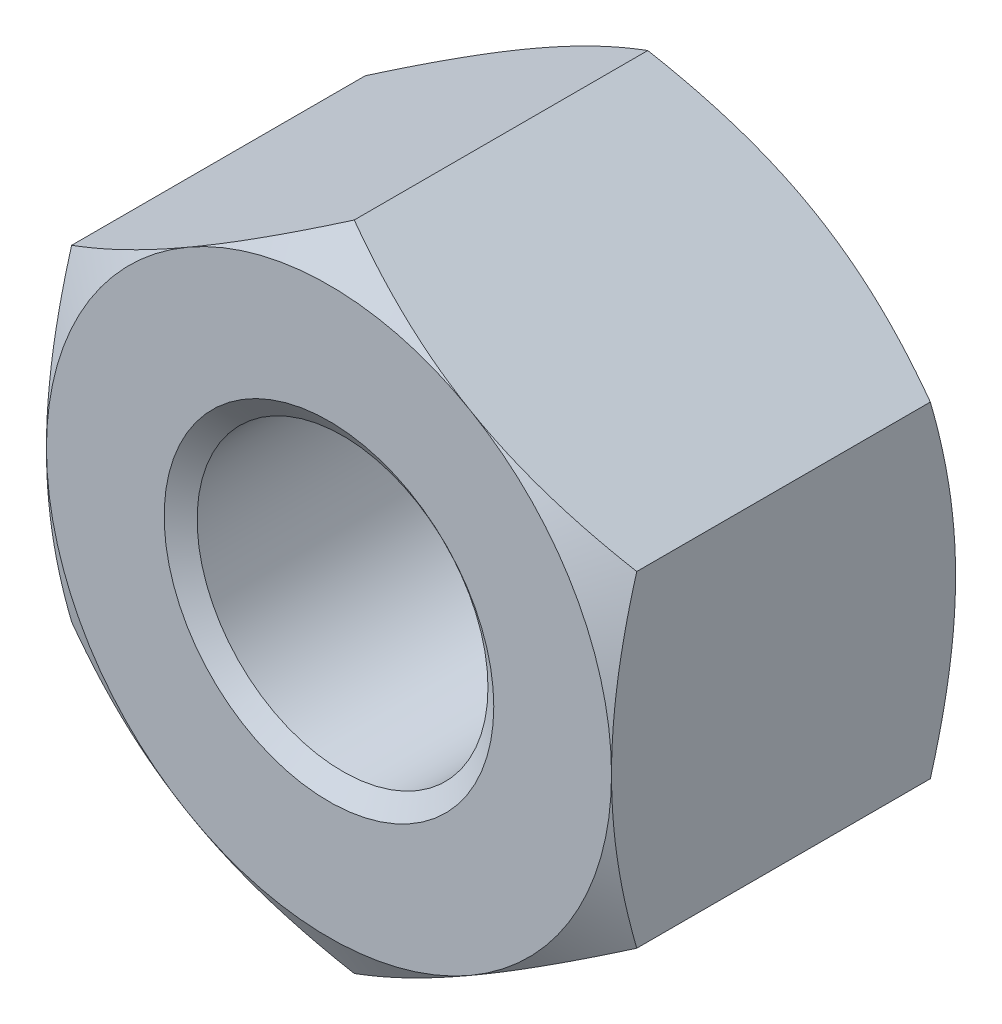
from build123d import *
from OCP.BRepFilletAPI import BRepFilletAPI_MakeChamfer

# Parameters (mm, degrees)
BASENUTSKE_R   = 8.75
BASENUT_DEPTH  = 20.7
CHAMFER1_SIZE  = 1.166666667
CHAMFER1_SIZE2 = 0.816908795


with BuildPart() as part:
    # BaseNutSke → BaseNut (new body)
    with BuildSketch(Plane.XY):
        Polygon((17, 9.814954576), (17, -9.814954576), (0, -19.629909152), (-17, -9.814954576), (-17, 9.814954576), (0, 19.629909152), align=None)
        Circle(BASENUTSKE_R, mode=Mode.SUBTRACT)
    extrude(amount=-BASENUT_DEPTH)

    # Sketch3 → Double-Chamfer (revolve, cut)
    with BuildSketch(Plane(origin=(0, 0, 0), x_dir=(0, 0, -1), z_dir=(1, 0, 0))):
        Polygon((20.7, 17), (19.181621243, 19.629909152), (19.181621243, 29.629909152), (30.7, 29.629909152), (30.7, 17), align=None)
        Polygon((1.518378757, 29.629909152), (-10, 29.629909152), (-10, 17), (0, 17), (1.518378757, 19.629909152), align=None)
    revolve(axis=Axis((0, 0, 0), (0, 0, -1)), mode=Mode.SUBTRACT)

    # Chamfer1: one chamfer whose edges measure the first distance from different faces: ONE call of the kernel's chamfer builder (chamfer() names one face for all edges)
    chamfer1_edges_1 = [part.edges().sort_by_distance(p)[0] for p in [
        (-8.75, 0, -20.7),
    ]]
    chamfer1_side_1 = [part.faces().sort_by_distance(p)[0] for p in [
        (14.306018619, 8.259583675, -20.7),
    ]]
    chamfer1_edges_2 = [part.edges().sort_by_distance(p)[0] for p in [
        (-8.75, 0, 0),
    ]]
    chamfer1_side_2 = [part.faces().sort_by_distance(p)[0] for p in [
        (14.306018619, 8.259583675, 0),
    ]]
    chamfer1 = BRepFilletAPI_MakeChamfer(part.part.solid().wrapped)
    for e in chamfer1_edges_1:
        chamfer1.Add(CHAMFER1_SIZE, CHAMFER1_SIZE2, e.wrapped, chamfer1_side_1[0].wrapped)  # the first distance lies on this face
    for e in chamfer1_edges_2:
        chamfer1.Add(CHAMFER1_SIZE, CHAMFER1_SIZE2, e.wrapped, chamfer1_side_2[0].wrapped)  # the first distance lies on this face
    add(Compound.cast(chamfer1.Shape()), mode=Mode.REPLACE)


solid = part.part
